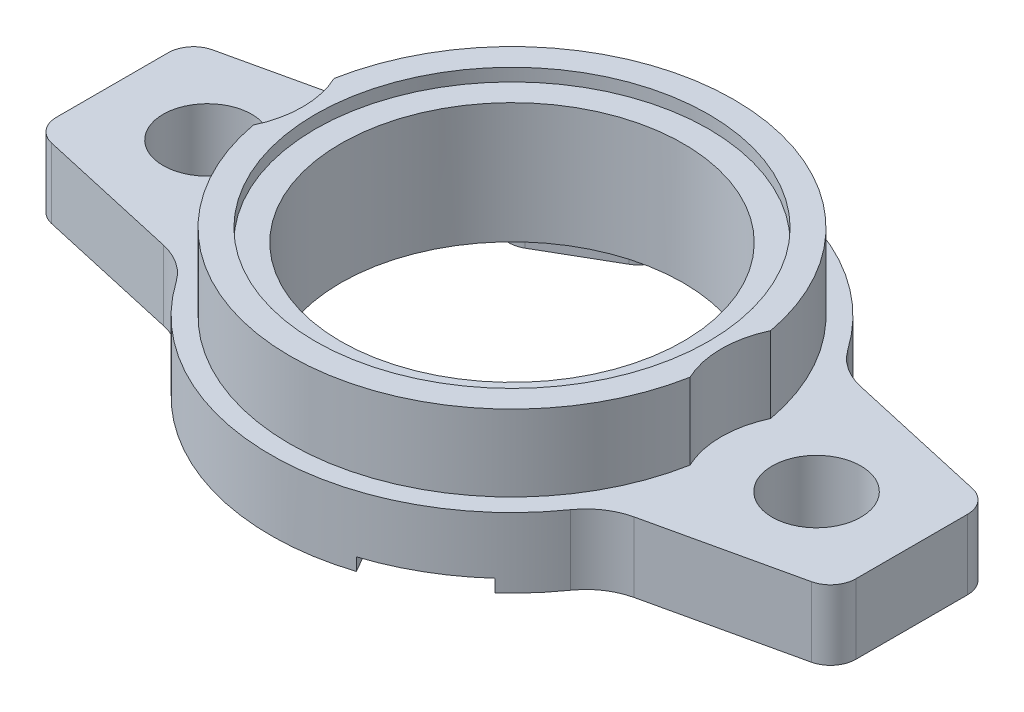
from build123d import *

# Parameters (mm, degrees)
SKETCH_1_R          = 3.5
SKETCH_1_R_2        = 19
EXTRUDE_1_DEPTH     = 11.5
SKETCH_2_R          = 42.113859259
CUT_EXTRUDE_1_DEPTH = 6
SKETCH_3_R          = 15.5
CUT_EXTRUDE_3_DEPTH = 1
CUT_EXTRUDE_4_DEPTH = 1
FILLET_1_R          = 5
SKETCH_5_R          = 13.5
CUT_EXTRUDE_6_DEPTH = 21


with BuildPart() as part:
    # Sketch 1 → Extrude 1 (new body)
    # profile 1 of 3: a face of its own
    with BuildSketch(Plane(origin=(0, 0, 0), x_dir=(1, 0, 0), z_dir=(0, 1, 0))):
        with BuildLine():
            ThreePointArc((-29.93902439, 6.351219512), (-31.061737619, 5.649390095), (-31.5, 4.4))
            Line((-31.5, 4.4), (-31.5, -4.4))
            ThreePointArc((-31.5, -4.4), (-31.061737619, -5.649390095), (-29.93902439, -6.351219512))
            Line((-29.93902439, -6.351219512), (-16.529826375, -9.368289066))
            ThreePointArc((-16.529826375, -9.368289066), (-19, 0), (-16.529826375, 9.368289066))
            Line((-16.529826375, 9.368289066), (-29.93902439, 6.351219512))
        make_face()
        with Locations(Location((-24, 0, 0), (0, 0, 270))):
            Circle(SKETCH_1_R, mode=Mode.SUBTRACT)
    # profile 2 of 3: a face of its own
    with BuildSketch(Plane(origin=(0, 0, 0), x_dir=(1, 0, 0), z_dir=(0, 1, 0))):
        Circle(SKETCH_1_R_2)
    # profile 3 of 3: a face of its own
    with BuildSketch(Plane(origin=(0, 0, 0), x_dir=(1, 0, 0), z_dir=(0, 1, 0))):
        with BuildLine():
            Line((29.93902439, 6.351219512), (16.529826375, 9.368289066))
            ThreePointArc((16.529826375, 9.368289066), (18.372080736, 4.844238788), (19, 0))
            ThreePointArc((19, 0), (18.372080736, -4.844238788), (16.529826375, -9.368289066))
            Line((16.529826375, -9.368289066), (29.93902439, -6.351219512))
            ThreePointArc((29.93902439, -6.351219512), (31.061737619, -5.649390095), (31.5, -4.4))
            Line((31.5, -4.4), (31.5, 4.4))
            ThreePointArc((31.5, 4.4), (31.061737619, 5.649390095), (29.93902439, 6.351219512))
        make_face()
        with Locations(Location((24, 0, 0), (0, 0, 270))):
            Circle(SKETCH_1_R, mode=Mode.SUBTRACT)
    extrude(amount=EXTRUDE_1_DEPTH)

    # Sketch 2 → Cut-Extrude 1 (cut)
    with BuildSketch(Plane(origin=(0, 11.5, 0), x_dir=(1, 0, 0), z_dir=(0, 1, 0))):
        Circle(SKETCH_2_R)
        with BuildLine():
            ThreePointArc((17.208333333, 3.1817077), (0, 17.5), (-17.208333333, 3.1817077))
            ThreePointArc((-17.208333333, 3.1817077), (-16.5, 0), (-17.208333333, -3.1817077))
            ThreePointArc((-17.208333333, -3.1817077), (0, -17.5), (17.208333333, -3.1817077))
            ThreePointArc((17.208333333, -3.1817077), (16.5, 0), (17.208333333, 3.1817077))
        make_face(mode=Mode.SUBTRACT)
    extrude(amount=-CUT_EXTRUDE_1_DEPTH, mode=Mode.SUBTRACT)

    # Sketch 3 → Cut-Extrude 3 (cut)
    with BuildSketch(Plane(origin=(0, 11.5, 0), x_dir=(1, 0, 0), z_dir=(0, 1, 0))):
        with Locations(Location((0, 0, 0), (0, 0, 270))):
            Circle(SKETCH_3_R)
    extrude(amount=-CUT_EXTRUDE_3_DEPTH, mode=Mode.SUBTRACT)

    # Sketch 4 → Cut-Extrude 4 (cut)
    with BuildSketch(Plane.XZ):
        with BuildLine():
            Line((-20.848643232, -5.321555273), (-15.718229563, -6.475898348))
            ThreePointArc((-15.718229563, -6.475898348), (-14.636214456, -8.647613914), (-13.256050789, -10.643172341))
            ThreePointArc((-13.256050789, -10.643172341), (-12.584964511, -11.011180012), (-11.850214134, -10.796871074))
            ThreePointArc((-11.850214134, -10.796871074), (-10.750830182, -10.362248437), (-9.598076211, -10.624355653))
            Line((-9.598076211, -10.624355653), (-4.401923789, -13.624355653))
            ThreePointArc((-4.401923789, -13.624355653), (-3.598555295, -14.491616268), (-3.425257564, -15.661022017))
            ThreePointArc((-3.425257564, -15.661022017), (-3.243479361, -16.404488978), (-2.58923223, -16.801662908))
            ThreePointArc((-2.58923223, -16.801662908), (8.351526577, -14.807160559), (15.718229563, -6.475898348))
            Line((15.718229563, -6.475898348), (20.848643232, -5.321555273))
            ThreePointArc((20.848643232, -5.321555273), (21.605203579, -4.563390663), (21.242016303, -3.555773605))
            ThreePointArc((21.242016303, -3.555773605), (19.5, 0), (21.242016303, 3.555773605))
            ThreePointArc((21.242016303, 3.555773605), (21.605203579, 4.563390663), (20.848643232, 5.321555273))
            Line((20.848643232, 5.321555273), (15.718229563, 6.475898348))
            ThreePointArc((15.718229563, 6.475898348), (14.636214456, 8.647613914), (13.256050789, 10.643172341))
            ThreePointArc((13.256050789, 10.643172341), (12.584964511, 11.011180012), (11.850214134, 10.796871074))
            ThreePointArc((11.850214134, 10.796871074), (10.750830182, 10.362248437), (9.598076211, 10.624355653))
            Line((9.598076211, 10.624355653), (4.401923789, 13.624355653))
            ThreePointArc((4.401923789, 13.624355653), (3.598555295, 14.491616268), (3.425257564, 15.661022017))
            ThreePointArc((3.425257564, 15.661022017), (3.243479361, 16.404488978), (2.58923223, 16.801662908))
            ThreePointArc((2.58923223, 16.801662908), (-8.351526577, 14.807160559), (-15.718229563, 6.475898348))
            Line((-15.718229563, 6.475898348), (-20.848643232, 5.321555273))
            ThreePointArc((-20.848643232, 5.321555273), (-21.605203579, 4.563390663), (-21.242016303, 3.555773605))
            ThreePointArc((-21.242016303, 3.555773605), (-19.5, 0), (-21.242016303, -3.555773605))
            ThreePointArc((-21.242016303, -3.555773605), (-21.605203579, -4.563390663), (-20.848643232, -5.321555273))
        make_face()
        with BuildLine():
            Line((6.035898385, 18.454482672), (12.964101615, 14.454482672))
            Line((12.964101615, 14.454482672), (11.464101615, 11.856406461))
            ThreePointArc((11.464101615, 11.856406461), (10.856895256, 11.390480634), (10.098076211, 11.490381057))
            Line((10.098076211, 11.490381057), (4.901923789, 14.490381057))
            ThreePointArc((4.901923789, 14.490381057), (4.435997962, 15.097587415), (4.535898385, 15.856406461))
            Line((4.535898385, 15.856406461), (6.035898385, 18.454482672))
        make_face()
        with BuildLine():
            Line((-6.035898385, -18.454482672), (-4.535898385, -15.856406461))
            ThreePointArc((-4.535898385, -15.856406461), (-4.435997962, -15.097587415), (-4.901923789, -14.490381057))
            Line((-4.901923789, -14.490381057), (-10.098076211, -11.490381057))
            ThreePointArc((-10.098076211, -11.490381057), (-10.856895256, -11.390480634), (-11.464101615, -11.856406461))
            Line((-11.464101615, -11.856406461), (-12.964101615, -14.454482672))
            Line((-12.964101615, -14.454482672), (-6.035898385, -18.454482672))
        make_face()
    extrude(amount=-CUT_EXTRUDE_4_DEPTH, mode=Mode.SUBTRACT)

    # Fillet 1
    fillet_1_edges = [part.edges().sort_by_distance(p)[0] for p in [
        (-16.529826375, 2.75, -9.368289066),
        (16.529826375, 2.75, -9.368289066),
        (16.529826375, 2.75, 9.368289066),
        (-16.529826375, 2.75, 9.368289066),
    ]]
    fillet(fillet_1_edges, radius=FILLET_1_R)

    # Sketch 5 → Cut-Extrude 6 (cut)
    with BuildSketch(Plane(origin=(0, 10.5, 0), x_dir=(1, 0, 0), z_dir=(0, 1, 0))):
        with Locations(Location((0, 0, 0), (0, 0, 270))):
            Circle(SKETCH_5_R)
    extrude(amount=-CUT_EXTRUDE_6_DEPTH, mode=Mode.SUBTRACT)


solid = part.part
